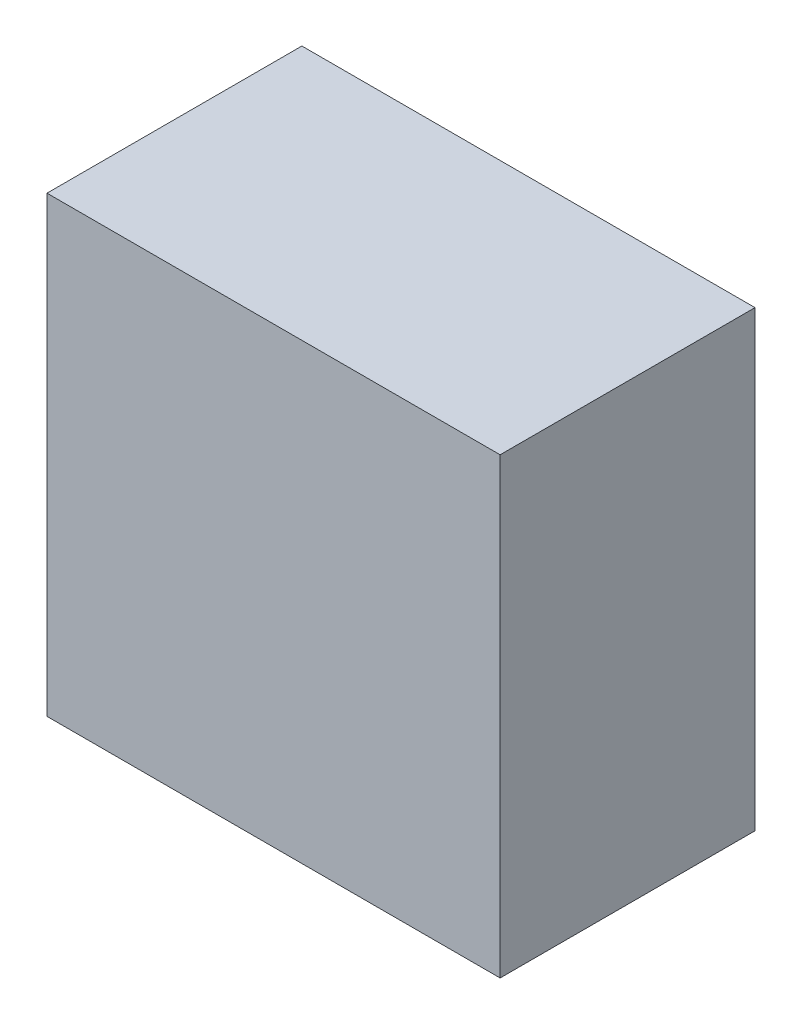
ISO-10303-21;
HEADER;
FILE_DESCRIPTION(('STEP AP214'),'2;1');
FILE_NAME('part.step','',(''),(''),'','','');
FILE_SCHEMA(('AUTOMOTIVE_DESIGN { 1 0 10303 214 1 1 1 1 }'));
ENDSEC;
DATA;
#1=APPLICATION_CONTEXT('core data for automotive mechanical design processes');
#2=APPLICATION_PROTOCOL_DEFINITION('international standard','automotive_design',2000,#1);
#3=PRODUCT_CONTEXT('',#1,'mechanical');
#4=PRODUCT('Part','Part','',(#3));
#5=PRODUCT_RELATED_PRODUCT_CATEGORY('part','',(#4));
#6=PRODUCT_DEFINITION_FORMATION('','',#4);
#7=PRODUCT_DEFINITION_CONTEXT('part definition',#1,'design');
#8=PRODUCT_DEFINITION('design','',#6,#7);
#9=PRODUCT_DEFINITION_SHAPE('','',#8);
#10=(LENGTH_UNIT() NAMED_UNIT(*) SI_UNIT(.MILLI.,.METRE.));
#11=(NAMED_UNIT(*) PLANE_ANGLE_UNIT() SI_UNIT($,.RADIAN.));
#12=(NAMED_UNIT(*) SI_UNIT($,.STERADIAN.) SOLID_ANGLE_UNIT());
#13=UNCERTAINTY_MEASURE_WITH_UNIT(LENGTH_MEASURE(1.E-05),#10,'distance_accuracy_value','');
#14=(GEOMETRIC_REPRESENTATION_CONTEXT(3) GLOBAL_UNCERTAINTY_ASSIGNED_CONTEXT((#13)) GLOBAL_UNIT_ASSIGNED_CONTEXT((#10,
#11,#12)) REPRESENTATION_CONTEXT('',''));
#15=CARTESIAN_POINT('',(0.,0.,0.));
#16=DIRECTION('',(0.,0.,1.));
#17=DIRECTION('',(1.,0.,0.));
#18=AXIS2_PLACEMENT_3D('',#15,#16,#17);
#19=CARTESIAN_POINT('',(-1.016,1.016,1.143));
#20=DIRECTION('',(0.,0.,-1.));
#21=DIRECTION('',(-1.,0.,0.));
#22=AXIS2_PLACEMENT_3D('',#19,#20,#21);
#23=PLANE('',#22);
#24=DIRECTION('',(1.,0.,0.));
#25=VECTOR('',#24,1.);
#26=CARTESIAN_POINT('',(-1.016,-1.016,1.143));
#27=LINE('',#26,#25);
#28=CARTESIAN_POINT('',(-1.016,-1.016,1.143));
#29=VERTEX_POINT('',#28);
#30=CARTESIAN_POINT('',(1.016,-1.016,1.143));
#31=VERTEX_POINT('',#30);
#32=EDGE_CURVE('E55',#29,#31,#27,.T.);
#33=ORIENTED_EDGE('',*,*,#32,.T.);
#34=DIRECTION('',(0.,1.,0.));
#35=VECTOR('',#34,1.);
#36=CARTESIAN_POINT('',(1.016,-1.016,1.143));
#37=LINE('',#36,#35);
#38=CARTESIAN_POINT('',(1.016,1.016,1.143));
#39=VERTEX_POINT('',#38);
#40=EDGE_CURVE('E57',#31,#39,#37,.T.);
#41=ORIENTED_EDGE('',*,*,#40,.T.);
#42=DIRECTION('',(1.,0.,0.));
#43=VECTOR('',#42,1.);
#44=CARTESIAN_POINT('',(1.016,1.016,1.143));
#45=LINE('',#44,#43);
#46=CARTESIAN_POINT('',(-1.016,1.016,1.143));
#47=VERTEX_POINT('',#46);
#48=EDGE_CURVE('E20',#39,#47,#45,.F.);
#49=ORIENTED_EDGE('',*,*,#48,.T.);
#50=DIRECTION('',(0.,1.,0.));
#51=VECTOR('',#50,1.);
#52=CARTESIAN_POINT('',(-1.016,1.016,1.143));
#53=LINE('',#52,#51);
#54=EDGE_CURVE('E80',#47,#29,#53,.F.);
#55=ORIENTED_EDGE('',*,*,#54,.T.);
#56=EDGE_LOOP('',(#33,#41,#49,#55));
#57=FACE_BOUND('',#56,.T.);
#58=ADVANCED_FACE('F17',(#57),#23,.F.);
#59=CARTESIAN_POINT('',(1.016,1.016,0.));
#60=DIRECTION('',(0.,-1.,0.));
#61=DIRECTION('',(0.,0.,-1.));
#62=AXIS2_PLACEMENT_3D('',#59,#60,#61);
#63=PLANE('',#62);
#64=DIRECTION('',(0.,0.,-1.));
#65=VECTOR('',#64,1.);
#66=CARTESIAN_POINT('',(-1.016,1.016,0.));
#67=LINE('',#66,#65);
#68=CARTESIAN_POINT('',(-1.016,1.016,0.));
#69=VERTEX_POINT('',#68);
#70=EDGE_CURVE('E68',#69,#47,#67,.F.);
#71=ORIENTED_EDGE('',*,*,#70,.T.);
#72=ORIENTED_EDGE('',*,*,#48,.F.);
#73=DIRECTION('',(0.,0.,1.));
#74=VECTOR('',#73,1.);
#75=CARTESIAN_POINT('',(1.016,1.016,0.));
#76=LINE('',#75,#74);
#77=CARTESIAN_POINT('',(1.016,1.016,0.));
#78=VERTEX_POINT('',#77);
#79=EDGE_CURVE('E63',#39,#78,#76,.F.);
#80=ORIENTED_EDGE('',*,*,#79,.T.);
#81=DIRECTION('',(-1.,0.,0.));
#82=VECTOR('',#81,1.);
#83=CARTESIAN_POINT('',(-1.016,1.016,0.));
#84=LINE('',#83,#82);
#85=EDGE_CURVE('E83',#69,#78,#84,.F.);
#86=ORIENTED_EDGE('',*,*,#85,.F.);
#87=EDGE_LOOP('',(#71,#72,#80,#86));
#88=FACE_BOUND('',#87,.T.);
#89=ADVANCED_FACE('F65',(#88),#63,.F.);
#90=CARTESIAN_POINT('',(1.016,-1.016,0.));
#91=DIRECTION('',(-1.,0.,0.));
#92=DIRECTION('',(0.,0.,1.));
#93=AXIS2_PLACEMENT_3D('',#90,#91,#92);
#94=PLANE('',#93);
#95=ORIENTED_EDGE('',*,*,#79,.F.);
#96=ORIENTED_EDGE('',*,*,#40,.F.);
#97=DIRECTION('',(0.,0.,1.));
#98=VECTOR('',#97,1.);
#99=CARTESIAN_POINT('',(1.016,-1.016,0.));
#100=LINE('',#99,#98);
#101=CARTESIAN_POINT('',(1.016,-1.016,0.));
#102=VERTEX_POINT('',#101);
#103=EDGE_CURVE('E75',#31,#102,#100,.F.);
#104=ORIENTED_EDGE('',*,*,#103,.T.);
#105=DIRECTION('',(0.,1.,0.));
#106=VECTOR('',#105,1.);
#107=CARTESIAN_POINT('',(1.016,1.016,0.));
#108=LINE('',#107,#106);
#109=EDGE_CURVE('E72',#78,#102,#108,.F.);
#110=ORIENTED_EDGE('',*,*,#109,.F.);
#111=EDGE_LOOP('',(#95,#96,#104,#110));
#112=FACE_BOUND('',#111,.T.);
#113=ADVANCED_FACE('F70',(#112),#94,.F.);
#114=CARTESIAN_POINT('',(-1.016,-1.016,0.));
#115=DIRECTION('',(0.,1.,0.));
#116=DIRECTION('',(0.,0.,1.));
#117=AXIS2_PLACEMENT_3D('',#114,#115,#116);
#118=PLANE('',#117);
#119=ORIENTED_EDGE('',*,*,#103,.F.);
#120=ORIENTED_EDGE('',*,*,#32,.F.);
#121=DIRECTION('',(0.,0.,-1.));
#122=VECTOR('',#121,1.);
#123=CARTESIAN_POINT('',(-1.016,-1.016,0.));
#124=LINE('',#123,#122);
#125=CARTESIAN_POINT('',(-1.016,-1.016,0.));
#126=VERTEX_POINT('',#125);
#127=EDGE_CURVE('E35',#29,#126,#124,.T.);
#128=ORIENTED_EDGE('',*,*,#127,.T.);
#129=DIRECTION('',(-1.,0.,0.));
#130=VECTOR('',#129,1.);
#131=CARTESIAN_POINT('',(-1.016,-1.016,0.));
#132=LINE('',#131,#130);
#133=EDGE_CURVE('E26',#102,#126,#132,.T.);
#134=ORIENTED_EDGE('',*,*,#133,.F.);
#135=EDGE_LOOP('',(#119,#120,#128,#134));
#136=FACE_BOUND('',#135,.T.);
#137=ADVANCED_FACE('F89',(#136),#118,.F.);
#138=CARTESIAN_POINT('',(-1.016,1.016,0.));
#139=DIRECTION('',(1.,0.,0.));
#140=DIRECTION('',(0.,0.,-1.));
#141=AXIS2_PLACEMENT_3D('',#138,#139,#140);
#142=PLANE('',#141);
#143=ORIENTED_EDGE('',*,*,#127,.F.);
#144=ORIENTED_EDGE('',*,*,#54,.F.);
#145=ORIENTED_EDGE('',*,*,#70,.F.);
#146=DIRECTION('',(0.,1.,0.));
#147=VECTOR('',#146,1.);
#148=CARTESIAN_POINT('',(-1.016,1.016,0.));
#149=LINE('',#148,#147);
#150=EDGE_CURVE('E11',#126,#69,#149,.T.);
#151=ORIENTED_EDGE('',*,*,#150,.F.);
#152=EDGE_LOOP('',(#143,#144,#145,#151));
#153=FACE_BOUND('',#152,.T.);
#154=ADVANCED_FACE('F91',(#153),#142,.F.);
#155=CARTESIAN_POINT('',(-1.016,1.016,0.));
#156=DIRECTION('',(0.,0.,-1.));
#157=DIRECTION('',(-1.,0.,0.));
#158=AXIS2_PLACEMENT_3D('',#155,#156,#157);
#159=PLANE('',#158);
#160=ORIENTED_EDGE('',*,*,#133,.T.);
#161=ORIENTED_EDGE('',*,*,#150,.T.);
#162=ORIENTED_EDGE('',*,*,#85,.T.);
#163=ORIENTED_EDGE('',*,*,#109,.T.);
#164=EDGE_LOOP('',(#160,#161,#162,#163));
#165=FACE_BOUND('',#164,.T.);
#166=ADVANCED_FACE('F88',(#165),#159,.T.);
#167=CLOSED_SHELL('',(#58,#89,#113,#137,#154,#166));
#168=MANIFOLD_SOLID_BREP('B1',#167);
#169=ADVANCED_BREP_SHAPE_REPRESENTATION('',(#18,#168),#14);
#170=SHAPE_DEFINITION_REPRESENTATION(#9,#169);
ENDSEC;
END-ISO-10303-21;
